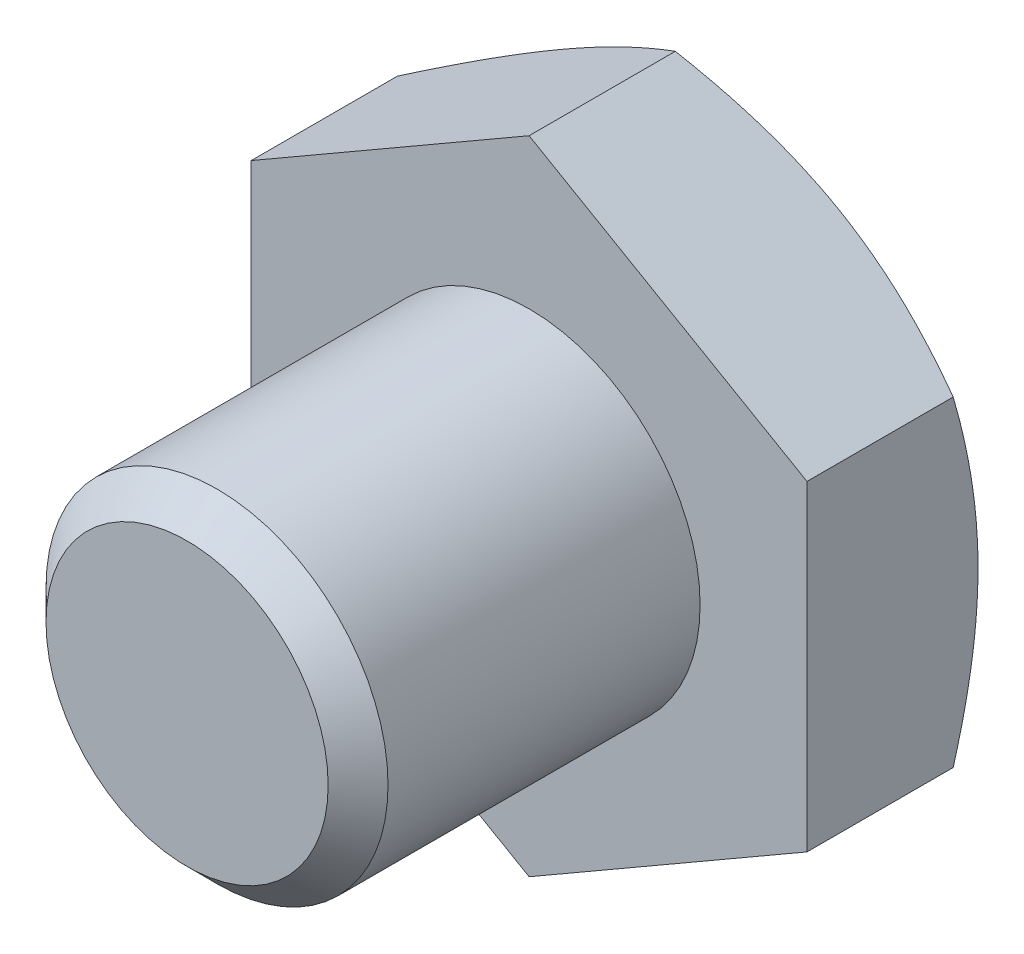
from build123d import *

# Parameters (mm, degrees)
ESQUISSE1_W        = 4
ESQUISSE1_H        = 8
CHANFREIN1_SIZE    = 0.7
BOSS_EXTRU_1_DEPTH = 4


with BuildPart() as part:
    # Esquisse1 → Base-R_volution (revolve)
    with BuildSketch(Plane(origin=(0, 0, 0), x_dir=(1, 0, 0), z_dir=(0, 1, 0))):
        with Locations((2, -4)):
            Rectangle(ESQUISSE1_W, ESQUISSE1_H)
    revolve(axis=Axis((0, 0, 0), (0, 0, 1)))

    # Chanfrein1
    chanfrein1_edges = [part.edges().sort_by_distance(p)[0] for p in [
        (-4, 0, 8),
    ]]
    chamfer(chanfrein1_edges, length=CHANFREIN1_SIZE)

    # Esquisse6 → Boss.-Extru.1 (add)
    with BuildSketch(Plane.XY):
        Polygon((6.5, -3.75277675), (6.5, 3.75277675), (0, 7.505553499), (-6.5, 3.75277675), (-6.5, -3.75277675), (0, -7.505553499), align=None)
    extrude(amount=-BOSS_EXTRU_1_DEPTH)

    # Esquisse7 → Enl_vement de mati_re-R_volution1 (revolve, cut)
    with BuildSketch(Plane(origin=(0, 0, 0), x_dir=(1, 0, 0), z_dir=(0, 1, 0))):
        Polygon((-6.5, 4), (-13.42820323, 4), (-13.42820323, 0), align=None)
    revolve(axis=Axis((0, 0, -6.239446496), (0, 0, 1)), mode=Mode.SUBTRACT)


solid = part.part
